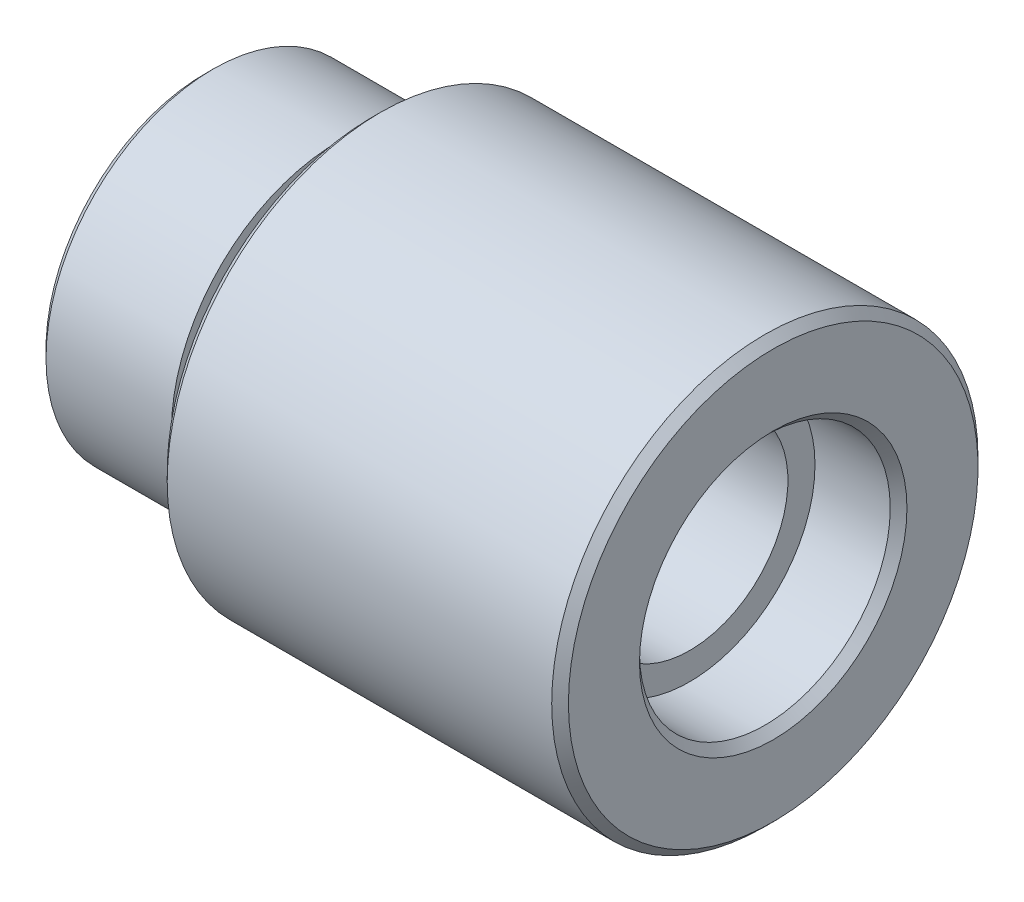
from build123d import *

# Parameters (mm, degrees)
CHANFREIN1_SIZE = 0.5


with BuildPart() as part:
    # Esquisse1 → Base-R_volution (revolve)
    with BuildSketch(Plane.XY, mode=Mode.PRIVATE) as base_r_volution_sk:
        Polygon((0, 7.5), (5, 7.5), (5, 5.88), (29, 5.88), (29, 7.5), (34, 7.5), (34, 12.75), (10, 12.75), (10, 9.25), (8, 9.25), (8, 10), (0, 10), align=None)
    revolve(base_r_volution_sk.sketch.rotate(Axis((0, 0, 0), (1, 0, 0)), 90), axis=Axis((0, 0, 0), (1, 0, 0)))

    # Chanfrein1
    chanfrein1_edges = [part.edges().sort_by_distance(p)[0] for p in [
        (0, 0, -7.5),
        (34, 0, -7.5),
        (34, 0, -12.75),
        (10, 0, -12.75),
        (0, 0, -10),
    ]]
    chamfer(chanfrein1_edges, length=CHANFREIN1_SIZE)


solid = part.part
